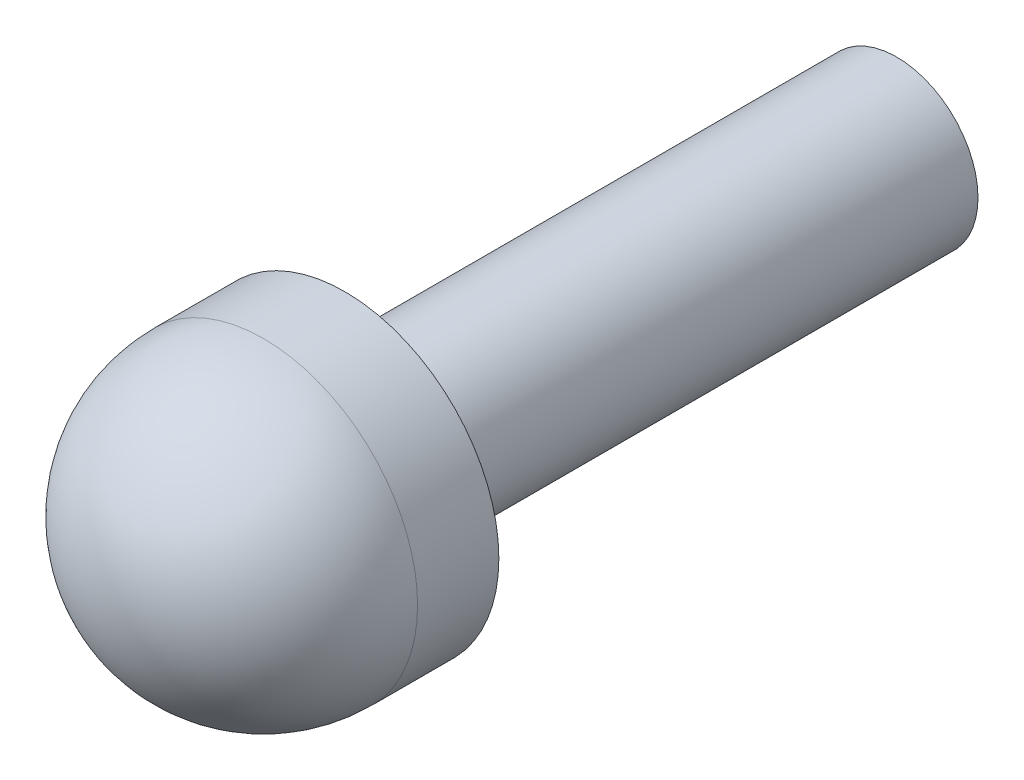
from build123d import *


with BuildPart() as part:
    # Sketch 1 → Revolve 1 (revolve)
    with BuildSketch(Plane(origin=(0, 0, 0), x_dir=(0, 0, -1), z_dir=(1, 0, 0)), mode=Mode.PRIVATE) as revolve_1_sk:
        with BuildLine():
            Line((0, 0), (4.6736, 0))
            Line((4.6736, 0), (4.6736, 0.4826))
            Line((4.6736, 0.4826), (1.397, 0.4826))
            Line((1.397, 0.4826), (1.397, 0.9144))
            Line((1.397, 0.9144), (0.9144, 0.9144))
            ThreePointArc((0.9144, 0.9144), (0.267821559, 0.646578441), (0, 0))
        make_face()
    revolve(revolve_1_sk.sketch.rotate(Axis((0, 0, 0), (0, 0, -1)), 90), axis=Axis((0, 0, 0), (0, 0, -1)))


solid = part.part
